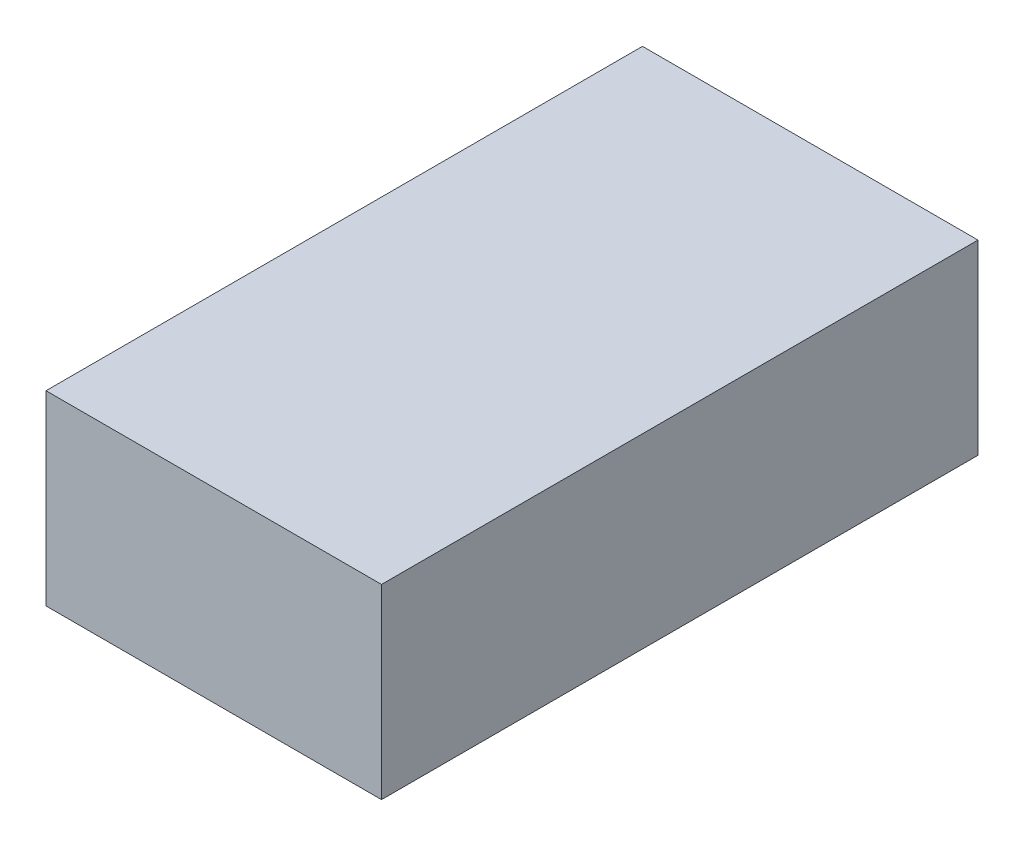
from build123d import *

# Parameters (mm, degrees)
SKETCH1_W           = 57.15
SKETCH1_H           = 31.75
BOSS_EXTRUDE1_DEPTH = 101.6


with BuildPart() as part:
    # Sketch1 → Boss-Extrude1 (new body)
    with BuildSketch(Plane.XY):
        Rectangle(SKETCH1_W, SKETCH1_H)
    extrude(amount=BOSS_EXTRUDE1_DEPTH)


solid = part.part
